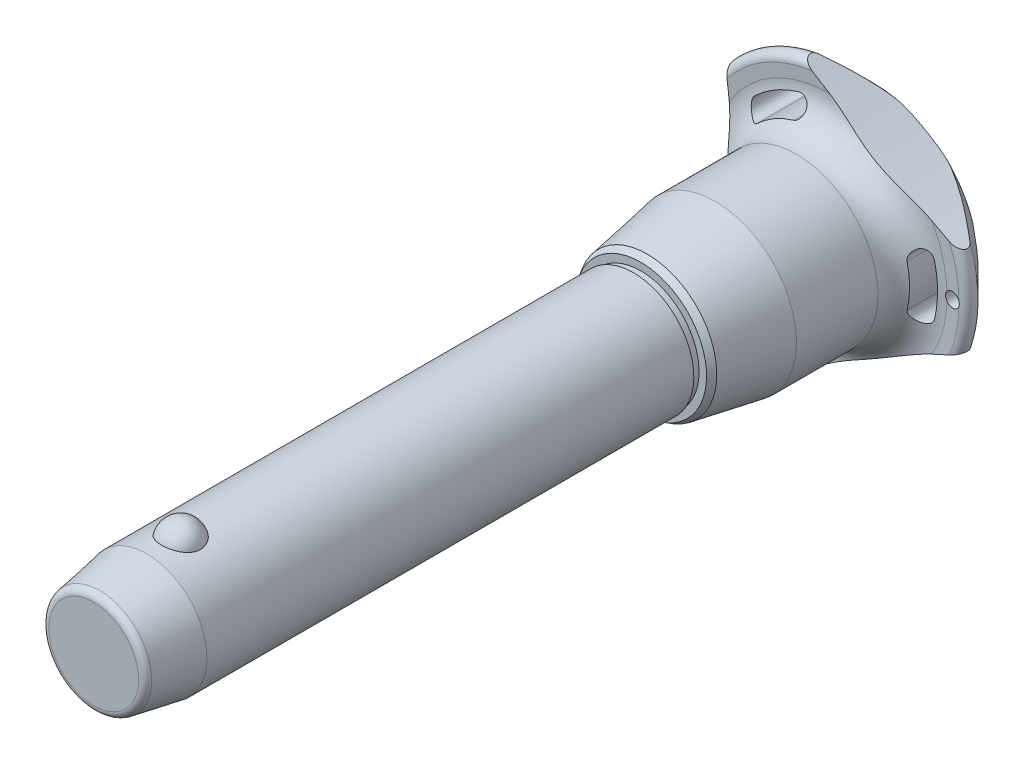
from build123d import *

# Parameters (mm, degrees)
SKETCH1_R           = 12.5
BOSS_EXTRUDE1_DEPTH = 90
SKETCH2_R           = 10
BOSS_EXTRUDE2_DEPTH = 50.7
BOSS_EXTRUDE3_START = 22
SKETCH1_2_R         = 12.5
BOSS_EXTRUDE3_DEPTH = 22
CHAMFER1_SIZE       = 11
CHAMFER1_SIZE2      = 1.939596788
FILLET1_R           = 1.5
SKETCH6_R           = 176.92625
CUT_EXTRUDE1_DEPTH  = 147.379068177
CIRPATTERN1_COUNT   = 3
SKETCH7_R           = 1.5
CUT_EXTRUDE2_DEPTH  = 147.275035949


with BuildPart() as part:
    # Sketch1 → Boss-Extrude1 (new body)
    with BuildSketch(Plane.XY):
        Circle(SKETCH1_R)
    extrude(amount=-BOSS_EXTRUDE1_DEPTH)

    # Sketch2 → Boss-Extrude2 (add)
    with BuildSketch(Plane(origin=(0, 0, -90), x_dir=(-1, 0, 0), z_dir=(0, 0, -1))):
        with Locations(Location((0, 0, 0), (0, 0, 180))):
            Circle(SKETCH2_R)
    extrude(amount=BOSS_EXTRUDE2_DEPTH)

    # Sketch3 → Revolve1 (revolve)
    with BuildSketch(Plane(origin=(0, 0, 0), x_dir=(0, 0, -1), z_dir=(1, 0, 0))):
        with BuildLine():
            Line((-3.957271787, 15.4), (-3.957271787, 7.1))
            ThreePointArc((-3.957271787, 7.1), (0.192728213, 11.25), (-3.957271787, 15.4))
        make_face()
        with BuildLine():
            Line((-3.957271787, -7.1), (-3.957271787, -15.4))
            ThreePointArc((-3.957271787, -15.4), (0.192728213, -11.25), (-3.957271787, -7.1))
        make_face()
    revolve(axis=Axis((0, -7.1, 3.957271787), (0, 1, 0)))

    # Sketch1_2 → Boss-Extrude3 (add)
    with BuildSketch(Plane.XY.offset(BOSS_EXTRUDE3_START)):
        Circle(SKETCH1_2_R)
    extrude(amount=-BOSS_EXTRUDE3_DEPTH)

    # Chamfer1
    chamfer1_edges = [part.edges().sort_by_distance(p)[0] for p in [
        (-12.5, 0, 22),
    ]]
    chamfer1_side = [part.faces().sort_by_distance(p)[0] for p in [
        (-12.5, 0, -34),
    ]]
    chamfer(chamfer1_edges, length=CHAMFER1_SIZE, length2=CHAMFER1_SIZE2, reference=chamfer1_side[0])

    # Fillet1
    fillet1_edges = [part.edges().sort_by_distance(p)[0] for p in [
        (-10.560403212, 0, 22),
        (-10, 0, -140.7),
    ]]
    fillet(fillet1_edges, radius=FILLET1_R)

    # Sketch4 → Revolve2 (revolve)
    with BuildSketch(Plane(origin=(0, 0, 0), x_dir=(0, 0, -1), z_dir=(1, 0, 0)), mode=Mode.PRIVATE) as revolve2_sk:
        Polygon((90, 0), (90, 12.089202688), (91.5, 12.089202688), (91.5, 13.644437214), (92.846872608, 14.422054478), (106.9, 16.9), (123.8, 16.9), (123.8, 0), align=None)
    revolve(revolve2_sk.sketch.rotate(Axis((0, 0, -123.8), (0, 0, 1)), 90), axis=Axis((0, 0, -123.8), (0, 0, 1)))

    # Sketch5 → Revolve3 (revolve)
    with BuildSketch(Plane(origin=(0, 0, 0), x_dir=(0, 0, -1), z_dir=(1, 0, 0)), mode=Mode.PRIVATE) as revolve3_sk:
        with BuildLine():
            Line((130.790129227, 24.271609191), (130.652256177, 26.865060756))
            ThreePointArc((130.652256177, 26.865060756), (131.598671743, 28.411427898), (133.38137085, 28.08137085))
            Line((133.38137085, 28.08137085), (139.763226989, 21.69951471))
            ThreePointArc((139.763226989, 21.69951471), (140.7, 19.381044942), (139.683055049, 17.096604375))
            ThreePointArc((139.683055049, 17.096604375), (134.18864484, 9.321268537), (132.25, 0))
            Line((132.25, 0), (123.8, 0))
            Line((123.8, 0), (123.8, 16.9))
            ThreePointArc((123.8, 16.9), (128.879432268, 19.083427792), (130.790129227, 24.271609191))
        make_face()
    revolve(revolve3_sk.sketch.rotate(Axis((0, 0, -132.25), (0, 0, 1)), 90), axis=Axis((0, 0, -132.25), (0, 0, 1)))

    # Sketch6 → Cut-Extrude1 (cut, through all)
    with BuildSketch(Plane.XY):
        with Locations((-197.42625, 0)):
            Circle(SKETCH6_R)
        with BuildLine():
            ThreePointArc((21.802992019, -5.260839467), (22.428706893, 0), (21.802992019, 5.260839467))
            ThreePointArc((21.802992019, 5.260839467), (19.579234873, 6.620060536), (18.220013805, 4.39630339))
            ThreePointArc((18.220013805, 4.39630339), (18.742902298, 0), (18.220013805, -4.39630339))
            ThreePointArc((18.220013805, -4.39630339), (19.579234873, -6.620060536), (21.802992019, -5.260839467))
        make_face()
    cut_extrude1 = extrude(amount=-CUT_EXTRUDE1_DEPTH, mode=Mode.SUBTRACT)

    # CirPattern1: Cut-Extrude1 ×3 about axis
    cirpattern1_axis = Axis((0, 0, 0), (0, 0, 1))
    for i in range(1, CIRPATTERN1_COUNT):
        add(cut_extrude1.rotate(cirpattern1_axis, i * 360 / CIRPATTERN1_COUNT), mode=Mode.SUBTRACT)

    # Sketch7 → Cut-Extrude2 (cut, through all)
    with BuildSketch(Plane.XY):
        with Locations(Location((25.428706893, 0, 0), (0, 0, 17.230769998))):
            Circle(SKETCH7_R)
    extrude(amount=-CUT_EXTRUDE2_DEPTH, mode=Mode.SUBTRACT)


solid = part.part
